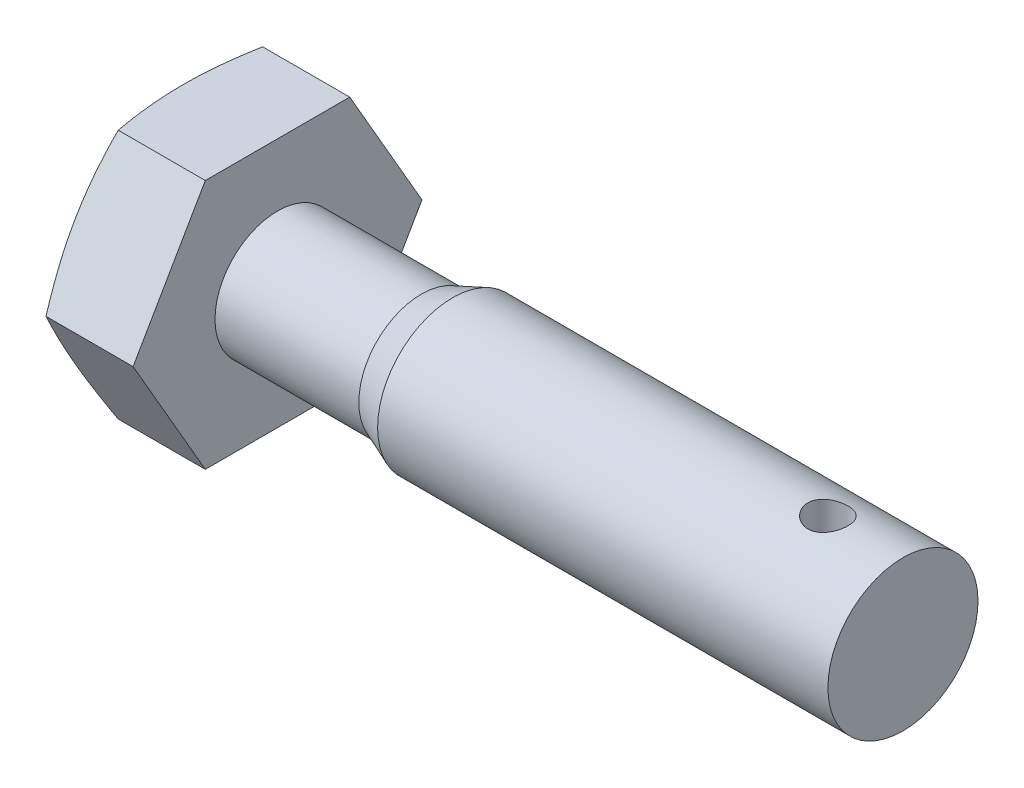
from build123d import *

# Parameters (mm, degrees)
BASEHEAD_DEPTH     = 4
SKETCH2_R          = 3
BASEBODY_DEPTH     = 25
SKETCH4_R          = 3.4
CUT_EXTRUDE1_DEPTH = 0.8
HOLE_DEPTH         = 30.988886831
HOLE_DEPTH_BACK    = 30.988886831
SKETCH6_R          = 0.8


with BuildPart() as part:
    # Sketch1 → BaseHead (new body)
    with BuildSketch(Plane(origin=(0, 0, 0), x_dir=(0, 0, -1), z_dir=(1, 0, 0))):
        Polygon((2.886751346, -5), (5.773502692, 0), (2.886751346, 5), (-2.886751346, 5), (-5.773502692, 0), (-2.886751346, -5), align=None)
    extrude(amount=BASEHEAD_DEPTH)

    # Sketch2 → BaseBody (add)
    with BuildSketch(Plane(origin=(4, 0, 0), x_dir=(0, 0, -1), z_dir=(1, 0, 0))):
        with Locations(Location((0, 0, 0), (0, 0, 180))):
            Circle(SKETCH2_R)
    extrude(amount=BASEBODY_DEPTH)

    # Sketch3 → HeadChamfer (revolve, cut)
    with BuildSketch(Plane(origin=(3.161211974, 0, 2.612290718), x_dir=(0, 0, -1), z_dir=(0, 1, 0)), mode=Mode.PRIVATE) as headchamfer_sk:
        Polygon((8.38579341, 3.161211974), (8.38579341, 2.643099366), (6.962290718, 3.161211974), align=None)
    revolve(headchamfer_sk.sketch.rotate(Axis((1.089857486, 0, 0), (1, 0, 0)), 180), axis=Axis((1.089857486, 0, 0), (1, 0, 0)), mode=Mode.SUBTRACT)

    # Sketch4 → Cut-Extrude1 (cut)
    with BuildSketch(Plane(origin=(0, 0, 0), x_dir=(0, 0, -1), z_dir=(1, 0, 0))):
        Circle(SKETCH4_R)
    extrude(amount=CUT_EXTRUDE1_DEPTH, mode=Mode.SUBTRACT)

    # Sketch5 → Cut-Revolve1 (revolve, cut)
    with BuildSketch(Plane(origin=(-2.92963122, 0, 7.92963122), x_dir=(0, 0, -1), z_dir=(0, 1, 0)), mode=Mode.PRIVATE) as cut_revolve1_sk:
        Polygon((10.92963122, -13.92963122), (10.42963122, -12.67963122), (10.42963122, -6.92963122), (12.92963122, -6.92963122), (12.92963122, -13.92963122), align=None)
    revolve(cut_revolve1_sk.sketch.rotate(Axis((0, 0, 0), (1, 0, 0)), 180), axis=Axis((0, 0, 0), (1, 0, 0)), mode=Mode.SUBTRACT)

    # Sketch6 → Hole (cut, two sides: drawn at the far end of the back side and taken through both)
    with BuildSketch(Plane(origin=(0, 0, 0), x_dir=(1, 0, 0), z_dir=(0, 1, 0)).offset(-HOLE_DEPTH_BACK)):
        with Locations(Location((26, 0, 0), (0, 0, 270))):
            Circle(SKETCH6_R)
    extrude(amount=HOLE_DEPTH + HOLE_DEPTH_BACK, mode=Mode.SUBTRACT)


solid = part.part
